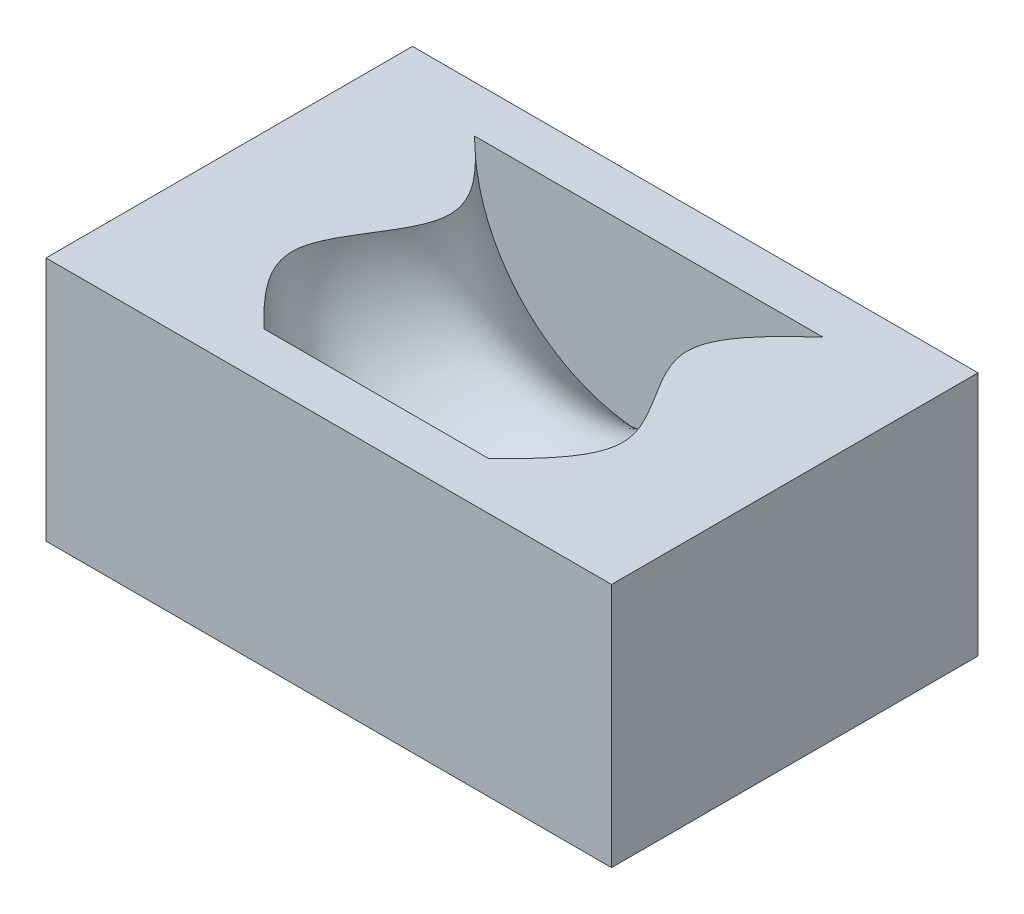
ISO-10303-21;
HEADER;
FILE_DESCRIPTION(('STEP AP214'),'2;1');
FILE_NAME('part.step','',(''),(''),'','','');
FILE_SCHEMA(('AUTOMOTIVE_DESIGN { 1 0 10303 214 1 1 1 1 }'));
ENDSEC;
DATA;
#1=APPLICATION_CONTEXT('core data for automotive mechanical design processes');
#2=APPLICATION_PROTOCOL_DEFINITION('international standard','automotive_design',2000,#1);
#3=PRODUCT_CONTEXT('',#1,'mechanical');
#4=PRODUCT('Part','Part','',(#3));
#5=PRODUCT_RELATED_PRODUCT_CATEGORY('part','',(#4));
#6=PRODUCT_DEFINITION_FORMATION('','',#4);
#7=PRODUCT_DEFINITION_CONTEXT('part definition',#1,'design');
#8=PRODUCT_DEFINITION('design','',#6,#7);
#9=PRODUCT_DEFINITION_SHAPE('','',#8);
#10=(LENGTH_UNIT() NAMED_UNIT(*) SI_UNIT(.MILLI.,.METRE.));
#11=(NAMED_UNIT(*) PLANE_ANGLE_UNIT() SI_UNIT($,.RADIAN.));
#12=(NAMED_UNIT(*) SI_UNIT($,.STERADIAN.) SOLID_ANGLE_UNIT());
#13=UNCERTAINTY_MEASURE_WITH_UNIT(LENGTH_MEASURE(1.E-05),#10,'distance_accuracy_value','');
#14=(GEOMETRIC_REPRESENTATION_CONTEXT(3) GLOBAL_UNCERTAINTY_ASSIGNED_CONTEXT((#13)) GLOBAL_UNIT_ASSIGNED_CONTEXT((#10,
#11,#12)) REPRESENTATION_CONTEXT('',''));
#15=CARTESIAN_POINT('',(0.,0.,0.));
#16=DIRECTION('',(0.,0.,1.));
#17=DIRECTION('',(1.,0.,0.));
#18=AXIS2_PLACEMENT_3D('',#15,#16,#17);
#19=CARTESIAN_POINT('',(-55.8773791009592,48.4691209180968,-36.2109426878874));
#20=DIRECTION('',(1.,0.,0.));
#21=DIRECTION('',(0.,0.,-1.));
#22=AXIS2_PLACEMENT_3D('',#19,#20,#21);
#23=PLANE('',#22);
#24=DIRECTION('',(0.,0.,1.));
#25=VECTOR('',#24,1.);
#26=CARTESIAN_POINT('',(-55.8773791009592,0.,-36.2109426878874));
#27=LINE('',#26,#25);
#28=CARTESIAN_POINT('',(-55.8773791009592,0.,-36.2109426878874));
#29=VERTEX_POINT('',#28);
#30=CARTESIAN_POINT('',(-55.8773791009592,0.,36.2109426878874));
#31=VERTEX_POINT('',#30);
#32=EDGE_CURVE('E134',#29,#31,#27,.T.);
#33=ORIENTED_EDGE('',*,*,#32,.T.);
#34=DIRECTION('',(0.,-1.,0.));
#35=VECTOR('',#34,1.);
#36=CARTESIAN_POINT('',(-55.8773791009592,48.4691209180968,36.2109426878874));
#37=LINE('',#36,#35);
#38=CARTESIAN_POINT('',(-55.8773791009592,48.4691209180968,36.2109426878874));
#39=VERTEX_POINT('',#38);
#40=EDGE_CURVE('E88',#39,#31,#37,.T.);
#41=ORIENTED_EDGE('',*,*,#40,.F.);
#42=DIRECTION('',(0.,0.,1.));
#43=VECTOR('',#42,1.);
#44=CARTESIAN_POINT('',(-55.8773791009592,48.4691209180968,-36.2109426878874));
#45=LINE('',#44,#43);
#46=CARTESIAN_POINT('',(-55.8773791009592,48.4691209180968,-36.2109426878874));
#47=VERTEX_POINT('',#46);
#48=EDGE_CURVE('E126',#47,#39,#45,.T.);
#49=ORIENTED_EDGE('',*,*,#48,.F.);
#50=DIRECTION('',(0.,-1.,0.));
#51=VECTOR('',#50,1.);
#52=CARTESIAN_POINT('',(-55.8773791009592,48.4691209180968,-36.2109426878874));
#53=LINE('',#52,#51);
#54=EDGE_CURVE('E118',#47,#29,#53,.T.);
#55=ORIENTED_EDGE('',*,*,#54,.T.);
#56=EDGE_LOOP('',(#33,#41,#49,#55));
#57=FACE_BOUND('',#56,.T.);
#58=ADVANCED_FACE('F32',(#57),#23,.F.);
#59=CARTESIAN_POINT('',(-55.8773791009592,48.4691209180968,36.2109426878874));
#60=DIRECTION('',(0.,0.,-1.));
#61=DIRECTION('',(-1.,0.,0.));
#62=AXIS2_PLACEMENT_3D('',#59,#60,#61);
#63=PLANE('',#62);
#64=DIRECTION('',(1.,0.,0.));
#65=VECTOR('',#64,1.);
#66=CARTESIAN_POINT('',(-55.8773791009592,0.,36.2109426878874));
#67=LINE('',#66,#65);
#68=CARTESIAN_POINT('',(55.8773791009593,0.,36.2109426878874));
#69=VERTEX_POINT('',#68);
#70=EDGE_CURVE('E132',#31,#69,#67,.T.);
#71=ORIENTED_EDGE('',*,*,#70,.T.);
#72=DIRECTION('',(0.,-1.,0.));
#73=VECTOR('',#72,1.);
#74=CARTESIAN_POINT('',(55.8773791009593,48.4691209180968,36.2109426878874));
#75=LINE('',#74,#73);
#76=CARTESIAN_POINT('',(55.8773791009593,48.4691209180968,36.2109426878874));
#77=VERTEX_POINT('',#76);
#78=EDGE_CURVE('E112',#77,#69,#75,.T.);
#79=ORIENTED_EDGE('',*,*,#78,.F.);
#80=DIRECTION('',(1.,0.,0.));
#81=VECTOR('',#80,1.);
#82=CARTESIAN_POINT('',(-55.8773791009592,48.4691209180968,36.2109426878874));
#83=LINE('',#82,#81);
#84=EDGE_CURVE('E124',#39,#77,#83,.T.);
#85=ORIENTED_EDGE('',*,*,#84,.F.);
#86=ORIENTED_EDGE('',*,*,#40,.T.);
#87=EDGE_LOOP('',(#71,#79,#85,#86));
#88=FACE_BOUND('',#87,.T.);
#89=ADVANCED_FACE('F164',(#88),#63,.F.);
#90=CARTESIAN_POINT('',(55.8773791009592,48.4691209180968,-36.2109426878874));
#91=DIRECTION('',(-1.,0.,0.));
#92=DIRECTION('',(0.,0.,1.));
#93=AXIS2_PLACEMENT_3D('',#90,#91,#92);
#94=PLANE('',#93);
#95=DIRECTION('',(0.,0.,-1.));
#96=VECTOR('',#95,1.);
#97=CARTESIAN_POINT('',(55.8773791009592,0.,-36.2109426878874));
#98=LINE('',#97,#96);
#99=CARTESIAN_POINT('',(55.8773791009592,0.,-36.2109426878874));
#100=VERTEX_POINT('',#99);
#101=EDGE_CURVE('E130',#69,#100,#98,.T.);
#102=ORIENTED_EDGE('',*,*,#101,.T.);
#103=DIRECTION('',(0.,-1.,0.));
#104=VECTOR('',#103,1.);
#105=CARTESIAN_POINT('',(55.8773791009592,48.4691209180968,-36.2109426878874));
#106=LINE('',#105,#104);
#107=CARTESIAN_POINT('',(55.8773791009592,48.4691209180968,-36.2109426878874));
#108=VERTEX_POINT('',#107);
#109=EDGE_CURVE('E115',#108,#100,#106,.T.);
#110=ORIENTED_EDGE('',*,*,#109,.F.);
#111=DIRECTION('',(0.,0.,-1.));
#112=VECTOR('',#111,1.);
#113=CARTESIAN_POINT('',(55.8773791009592,48.4691209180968,-36.2109426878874));
#114=LINE('',#113,#112);
#115=EDGE_CURVE('E122',#77,#108,#114,.T.);
#116=ORIENTED_EDGE('',*,*,#115,.F.);
#117=ORIENTED_EDGE('',*,*,#78,.T.);
#118=EDGE_LOOP('',(#102,#110,#116,#117));
#119=FACE_BOUND('',#118,.T.);
#120=ADVANCED_FACE('F161',(#119),#94,.F.);
#121=CARTESIAN_POINT('',(-55.8773791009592,48.4691209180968,-36.2109426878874));
#122=DIRECTION('',(0.,0.,1.));
#123=DIRECTION('',(1.,0.,0.));
#124=AXIS2_PLACEMENT_3D('',#121,#122,#123);
#125=PLANE('',#124);
#126=DIRECTION('',(-1.,0.,0.));
#127=VECTOR('',#126,1.);
#128=CARTESIAN_POINT('',(-55.8773791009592,0.,-36.2109426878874));
#129=LINE('',#128,#127);
#130=EDGE_CURVE('E128',#100,#29,#129,.T.);
#131=ORIENTED_EDGE('',*,*,#130,.T.);
#132=ORIENTED_EDGE('',*,*,#54,.F.);
#133=DIRECTION('',(-1.,0.,0.));
#134=VECTOR('',#133,1.);
#135=CARTESIAN_POINT('',(-55.8773791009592,48.4691209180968,-36.2109426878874));
#136=LINE('',#135,#134);
#137=EDGE_CURVE('E53',#108,#47,#136,.T.);
#138=ORIENTED_EDGE('',*,*,#137,.F.);
#139=ORIENTED_EDGE('',*,*,#109,.T.);
#140=EDGE_LOOP('',(#131,#132,#138,#139));
#141=FACE_BOUND('',#140,.T.);
#142=ADVANCED_FACE('F158',(#141),#125,.F.);
#143=CARTESIAN_POINT('',(-55.8773791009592,48.4691209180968,36.2109426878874));
#144=DIRECTION('',(0.,1.,0.));
#145=DIRECTION('',(0.,0.,1.));
#146=AXIS2_PLACEMENT_3D('',#143,#144,#145);
#147=PLANE('',#146);
#148=DIRECTION('',(-1.,0.,0.));
#149=VECTOR('',#148,1.);
#150=CARTESIAN_POINT('',(-55.8773791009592,48.4691209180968,-27.0016983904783));
#151=LINE('',#150,#149);
#152=CARTESIAN_POINT('',(34.4197473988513,48.4691209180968,-27.0016983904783));
#153=VERTEX_POINT('',#152);
#154=CARTESIAN_POINT('',(-34.4197473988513,48.4691209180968,-27.0016983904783));
#155=VERTEX_POINT('',#154);
#156=EDGE_CURVE('E11',#153,#155,#151,.T.);
#157=ORIENTED_EDGE('',*,*,#156,.F.);
#158=CARTESIAN_POINT('',(22.2541470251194,48.4691209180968,26.8049612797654));
#159=CARTESIAN_POINT('',(27.6690273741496,48.4691209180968,21.376519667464));
#160=CARTESIAN_POINT('',(39.3342668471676,48.4691209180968,9.68206525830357));
#161=CARTESIAN_POINT('',(16.6023350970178,48.4691209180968,-10.3666950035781));
#162=CARTESIAN_POINT('',(28.7722656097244,48.4691209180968,-21.7289978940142));
#163=CARTESIAN_POINT('',(34.4197473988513,48.4691209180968,-27.0016983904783));
#164=B_SPLINE_CURVE_WITH_KNOTS('',3,(#158,#159,#160,#161,#162,#163),.UNSPECIFIED.,.F.,.F.,(4,1,
1,4),(0.,0.317083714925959,0.683091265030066,1.),.UNSPECIFIED.);
#165=CARTESIAN_POINT('',(22.2541470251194,48.4691209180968,26.8049612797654));
#166=VERTEX_POINT('',#165);
#167=EDGE_CURVE('E87',#166,#153,#164,.T.);
#168=ORIENTED_EDGE('',*,*,#167,.F.);
#169=DIRECTION('',(1.,0.,0.));
#170=VECTOR('',#169,1.);
#171=CARTESIAN_POINT('',(-55.8773791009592,48.4691209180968,26.8049612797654));
#172=LINE('',#171,#170);
#173=CARTESIAN_POINT('',(-22.2541470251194,48.4691209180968,26.8049612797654));
#174=VERTEX_POINT('',#173);
#175=EDGE_CURVE('E82',#174,#166,#172,.T.);
#176=ORIENTED_EDGE('',*,*,#175,.F.);
#177=CARTESIAN_POINT('',(-22.2541470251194,48.4691209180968,26.8049612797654));
#178=CARTESIAN_POINT('',(-27.6690273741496,48.4691209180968,21.376519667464));
#179=CARTESIAN_POINT('',(-39.3342668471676,48.4691209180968,9.68206525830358));
#180=CARTESIAN_POINT('',(-16.6023350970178,48.4691209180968,-10.3666950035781));
#181=CARTESIAN_POINT('',(-28.7722656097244,48.4691209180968,-21.7289978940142));
#182=CARTESIAN_POINT('',(-34.4197473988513,48.4691209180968,-27.0016983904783));
#183=B_SPLINE_CURVE_WITH_KNOTS('',3,(#177,#178,#179,#180,#181,#182),.UNSPECIFIED.,.F.,.F.,(4,1,
1,4),(0.,0.317083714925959,0.683091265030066,1.),.UNSPECIFIED.);
#184=EDGE_CURVE('E39',#155,#174,#183,.F.);
#185=ORIENTED_EDGE('',*,*,#184,.F.);
#186=EDGE_LOOP('',(#157,#168,#176,#185));
#187=FACE_BOUND('',#186,.T.);
#188=ORIENTED_EDGE('',*,*,#48,.T.);
#189=ORIENTED_EDGE('',*,*,#84,.T.);
#190=ORIENTED_EDGE('',*,*,#115,.T.);
#191=ORIENTED_EDGE('',*,*,#137,.T.);
#192=EDGE_LOOP('',(#188,#189,#190,#191));
#193=FACE_BOUND('',#192,.T.);
#194=ADVANCED_FACE('F97',(#187,#193),#147,.T.);
#195=CARTESIAN_POINT('',(-55.8773791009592,0.,36.2109426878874));
#196=DIRECTION('',(0.,1.,0.));
#197=DIRECTION('',(0.,0.,1.));
#198=AXIS2_PLACEMENT_3D('',#195,#196,#197);
#199=PLANE('',#198);
#200=ORIENTED_EDGE('',*,*,#32,.F.);
#201=ORIENTED_EDGE('',*,*,#130,.F.);
#202=ORIENTED_EDGE('',*,*,#101,.F.);
#203=ORIENTED_EDGE('',*,*,#70,.F.);
#204=EDGE_LOOP('',(#200,#201,#202,#203));
#205=FACE_BOUND('',#204,.T.);
#206=ADVANCED_FACE('F151',(#205),#199,.F.);
#207=CARTESIAN_POINT('',(0.,48.4691209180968,-27.0016983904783));
#208=DIRECTION('',(0.,0.,-1.));
#209=DIRECTION('',(-1.,0.,0.));
#210=AXIS2_PLACEMENT_3D('',#207,#208,#209);
#211=PLANE('',#210);
#212=ORIENTED_EDGE('',*,*,#156,.T.);
#213=CARTESIAN_POINT('',(0.,48.4691209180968,-27.0016983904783));
#214=DIRECTION('',(0.,0.,1.));
#215=DIRECTION('',(1.,0.,0.));
#216=AXIS2_PLACEMENT_3D('',#213,#214,#215);
#217=CIRCLE('',#216,34.4197473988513);
#218=EDGE_CURVE('E94',#155,#153,#217,.T.);
#219=ORIENTED_EDGE('',*,*,#218,.T.);
#220=EDGE_LOOP('',(#212,#219));
#221=FACE_BOUND('',#220,.T.);
#222=ADVANCED_FACE('F148',(#221),#211,.F.);
#223=CARTESIAN_POINT('',(22.2541470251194,48.4691209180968,26.8049612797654));
#224=CARTESIAN_POINT('',(27.6690273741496,48.4691209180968,21.376519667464));
#225=CARTESIAN_POINT('',(39.3342668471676,48.4691209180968,9.68206525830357));
#226=CARTESIAN_POINT('',(16.6023350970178,48.4691209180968,-10.3666950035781));
#227=CARTESIAN_POINT('',(28.7722656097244,48.4691209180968,-21.7289978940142));
#228=CARTESIAN_POINT('',(34.4197473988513,48.4691209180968,-27.0016983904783));
#229=B_SPLINE_CURVE_WITH_KNOTS('',3,(#223,#224,#225,#226,#227,#228),.UNSPECIFIED.,.F.,.F.,(4,1,
1,4),(0.,0.317083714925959,0.683091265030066,1.),.UNSPECIFIED.);
#230=CARTESIAN_POINT('',(0.,48.4691209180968,36.2109426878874));
#231=DIRECTION('',(0.,0.,1.));
#232=AXIS1_PLACEMENT('',#230,#231);
#233=SURFACE_OF_REVOLUTION('',#229,#232);
#234=ORIENTED_EDGE('',*,*,#184,.T.);
#235=CARTESIAN_POINT('',(0.,48.4691209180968,26.8049612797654));
#236=DIRECTION('',(0.,0.,1.));
#237=DIRECTION('',(1.,0.,0.));
#238=AXIS2_PLACEMENT_3D('',#235,#236,#237);
#239=CIRCLE('',#238,22.2541470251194);
#240=EDGE_CURVE('E45',#174,#166,#239,.T.);
#241=ORIENTED_EDGE('',*,*,#240,.T.);
#242=ORIENTED_EDGE('',*,*,#167,.T.);
#243=ORIENTED_EDGE('',*,*,#218,.F.);
#244=EDGE_LOOP('',(#234,#241,#242,#243));
#245=FACE_BOUND('',#244,.T.);
#246=ADVANCED_FACE('F91',(#245),#233,.T.);
#247=CARTESIAN_POINT('',(22.2541470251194,48.4691209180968,26.8049612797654));
#248=DIRECTION('',(0.,0.,1.));
#249=DIRECTION('',(1.,0.,0.));
#250=AXIS2_PLACEMENT_3D('',#247,#248,#249);
#251=PLANE('',#250);
#252=ORIENTED_EDGE('',*,*,#175,.T.);
#253=ORIENTED_EDGE('',*,*,#240,.F.);
#254=EDGE_LOOP('',(#252,#253));
#255=FACE_BOUND('',#254,.T.);
#256=ADVANCED_FACE('F83',(#255),#251,.F.);
#257=CLOSED_SHELL('',(#58,#89,#120,#142,#194,#206,#222,#246,#256));
#258=MANIFOLD_SOLID_BREP('B2',#257);
#259=ADVANCED_BREP_SHAPE_REPRESENTATION('',(#18,#258),#14);
#260=SHAPE_DEFINITION_REPRESENTATION(#9,#259);
ENDSEC;
END-ISO-10303-21;
